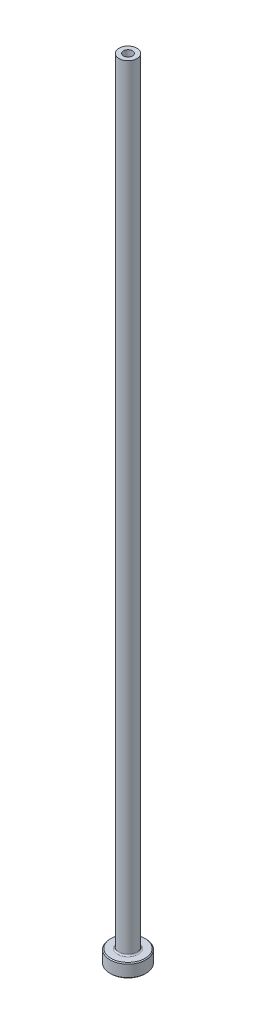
from build123d import *

# Parameters (mm, degrees)
FILLET1_R     = 0.3
CHAMFER1_SIZE = 0.2
CHAMFER3_SIZE = 0.5


with BuildPart() as part:
    # Sketch1 → Revolve1 (revolve)
    with BuildSketch(Plane.XY, mode=Mode.PRIVATE) as revolve1_sk:
        Polygon((-1, 175), (-2, 175), (-2, 3), (-4, 3), (-4, 0), (-1.25, 0), (-1.25, 128), (-1, 140), align=None)
    revolve(revolve1_sk.sketch.rotate(Axis((0, 92.187680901, 0), (0, -1, 0)), 270), axis=Axis((0, 92.187680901, 0), (0, -1, 0)))

    # Fillet1
    fillet1_edges = [part.edges().sort_by_distance(p)[0] for p in [
        (0, 3, -2),
    ]]
    fillet(fillet1_edges, radius=FILLET1_R)

    # Chamfer1
    chamfer1_edges = [part.edges().sort_by_distance(p)[0] for p in [
        (0, 0, -4),
        (0, 3, -4),
    ]]
    chamfer(chamfer1_edges, length=CHAMFER1_SIZE)

    # Chamfer3
    chamfer3_edges = [part.edges().sort_by_distance(p)[0] for p in [
        (0, 0, -1.25),
    ]]
    chamfer(chamfer3_edges, length=CHAMFER3_SIZE)


solid = part.part
